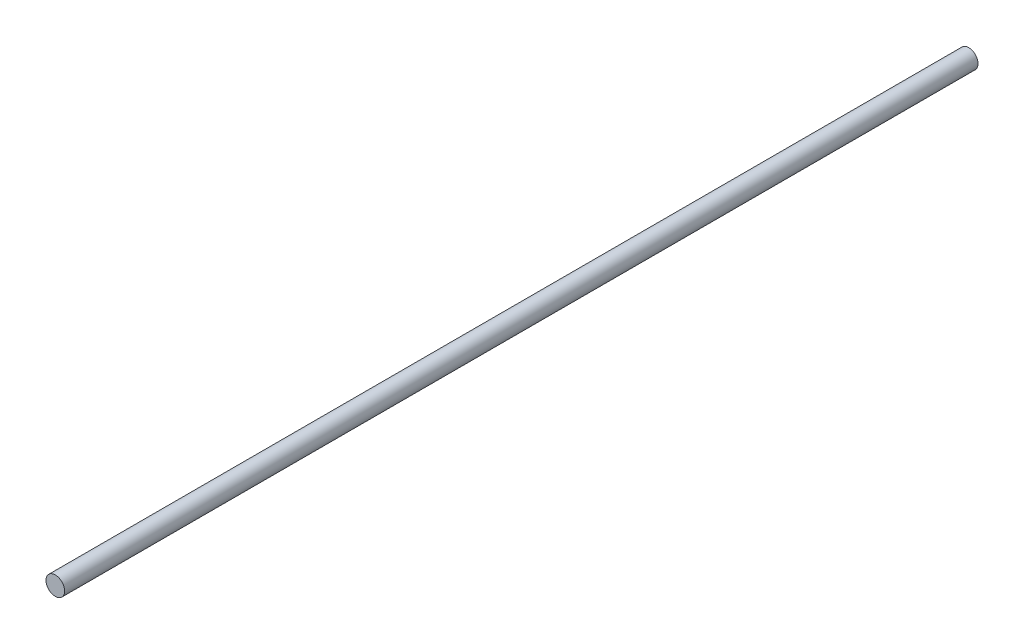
ISO-10303-21;
HEADER;
FILE_DESCRIPTION(('STEP AP214'),'2;1');
FILE_NAME('part.step','',(''),(''),'','','');
FILE_SCHEMA(('AUTOMOTIVE_DESIGN { 1 0 10303 214 1 1 1 1 }'));
ENDSEC;
DATA;
#1=APPLICATION_CONTEXT('core data for automotive mechanical design processes');
#2=APPLICATION_PROTOCOL_DEFINITION('international standard','automotive_design',2000,#1);
#3=PRODUCT_CONTEXT('',#1,'mechanical');
#4=PRODUCT('Part','Part','',(#3));
#5=PRODUCT_RELATED_PRODUCT_CATEGORY('part','',(#4));
#6=PRODUCT_DEFINITION_FORMATION('','',#4);
#7=PRODUCT_DEFINITION_CONTEXT('part definition',#1,'design');
#8=PRODUCT_DEFINITION('design','',#6,#7);
#9=PRODUCT_DEFINITION_SHAPE('','',#8);
#10=(LENGTH_UNIT() NAMED_UNIT(*) SI_UNIT(.MILLI.,.METRE.));
#11=(NAMED_UNIT(*) PLANE_ANGLE_UNIT() SI_UNIT($,.RADIAN.));
#12=(NAMED_UNIT(*) SI_UNIT($,.STERADIAN.) SOLID_ANGLE_UNIT());
#13=UNCERTAINTY_MEASURE_WITH_UNIT(LENGTH_MEASURE(1.E-05),#10,'distance_accuracy_value','');
#14=(GEOMETRIC_REPRESENTATION_CONTEXT(3) GLOBAL_UNCERTAINTY_ASSIGNED_CONTEXT((#13)) GLOBAL_UNIT_ASSIGNED_CONTEXT((#10,
#11,#12)) REPRESENTATION_CONTEXT('',''));
#15=CARTESIAN_POINT('',(0.,0.,0.));
#16=DIRECTION('',(0.,0.,1.));
#17=DIRECTION('',(1.,0.,0.));
#18=AXIS2_PLACEMENT_3D('',#15,#16,#17);
#19=CARTESIAN_POINT('',(0.,0.,0.));
#20=DIRECTION('',(0.,0.,1.));
#21=DIRECTION('',(1.,0.,0.));
#22=AXIS2_PLACEMENT_3D('',#19,#20,#21);
#23=PLANE('',#22);
#24=CARTESIAN_POINT('',(0.,0.,0.));
#25=DIRECTION('',(0.,0.,-1.));
#26=DIRECTION('',(-1.,0.,0.));
#27=AXIS2_PLACEMENT_3D('',#24,#25,#26);
#28=CIRCLE('',#27,5.);
#29=CARTESIAN_POINT('',(-5.,0.,0.));
#30=VERTEX_POINT('',#29);
#31=EDGE_CURVE('E19',#30,#30,#28,.T.);
#32=ORIENTED_EDGE('',*,*,#31,.T.);
#33=EDGE_LOOP('',(#32));
#34=FACE_BOUND('',#33,.T.);
#35=ADVANCED_FACE('F12',(#34),#23,.F.);
#36=CARTESIAN_POINT('',(0.,0.,490.));
#37=DIRECTION('',(0.,0.,-1.));
#38=DIRECTION('',(-1.,0.,0.));
#39=AXIS2_PLACEMENT_3D('',#36,#37,#38);
#40=CYLINDRICAL_SURFACE('',#39,5.);
#41=CARTESIAN_POINT('',(0.,0.,490.));
#42=DIRECTION('',(0.,0.,1.));
#43=DIRECTION('',(1.,0.,0.));
#44=AXIS2_PLACEMENT_3D('',#41,#42,#43);
#45=CIRCLE('',#44,5.);
#46=CARTESIAN_POINT('',(5.,0.,490.));
#47=VERTEX_POINT('',#46);
#48=EDGE_CURVE('E8',#47,#47,#45,.F.);
#49=ORIENTED_EDGE('',*,*,#48,.T.);
#50=EDGE_LOOP('',(#49));
#51=FACE_BOUND('',#50,.T.);
#52=ORIENTED_EDGE('',*,*,#31,.F.);
#53=EDGE_LOOP('',(#52));
#54=FACE_BOUND('',#53,.T.);
#55=ADVANCED_FACE('F14',(#51,#54),#40,.T.);
#56=CARTESIAN_POINT('',(0.,0.,490.));
#57=DIRECTION('',(0.,0.,1.));
#58=DIRECTION('',(1.,0.,0.));
#59=AXIS2_PLACEMENT_3D('',#56,#57,#58);
#60=PLANE('',#59);
#61=ORIENTED_EDGE('',*,*,#48,.F.);
#62=EDGE_LOOP('',(#61));
#63=FACE_BOUND('',#62,.T.);
#64=ADVANCED_FACE('F27',(#63),#60,.T.);
#65=CLOSED_SHELL('',(#35,#55,#64));
#66=MANIFOLD_SOLID_BREP('B1',#65);
#67=ADVANCED_BREP_SHAPE_REPRESENTATION('',(#18,#66),#14);
#68=SHAPE_DEFINITION_REPRESENTATION(#9,#67);
ENDSEC;
END-ISO-10303-21;
